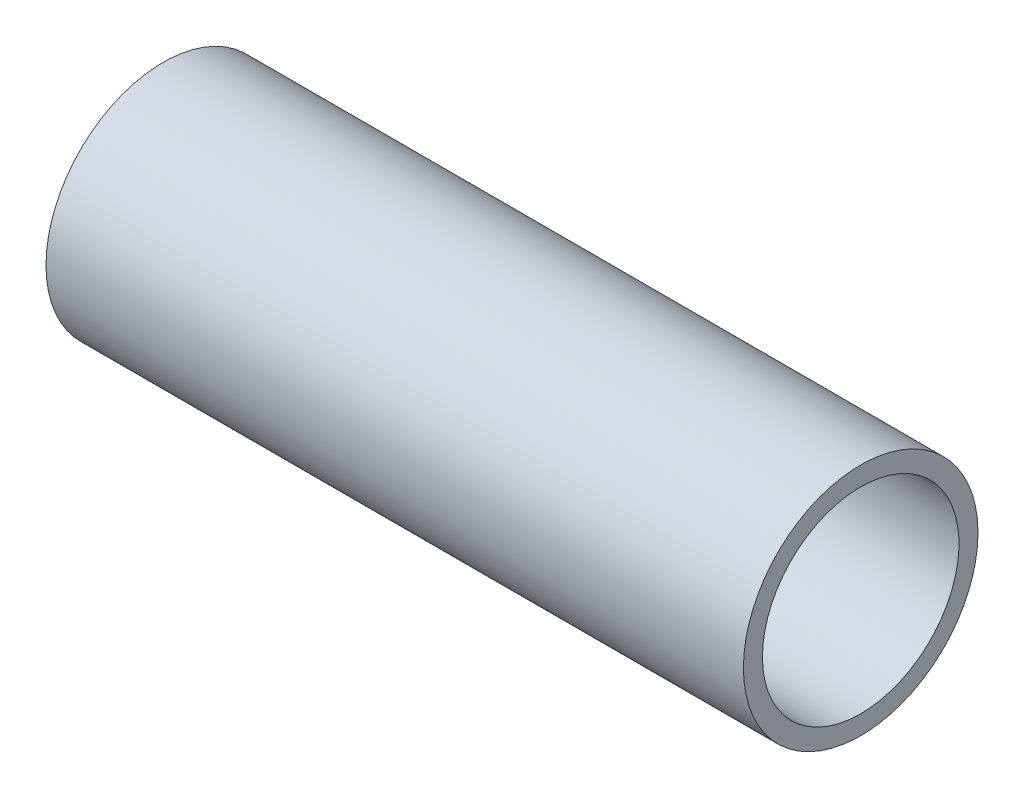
ISO-10303-21;
HEADER;
FILE_DESCRIPTION(('STEP AP214'),'2;1');
FILE_NAME('part.step','',(''),(''),'','','');
FILE_SCHEMA(('AUTOMOTIVE_DESIGN { 1 0 10303 214 1 1 1 1 }'));
ENDSEC;
DATA;
#1=APPLICATION_CONTEXT('core data for automotive mechanical design processes');
#2=APPLICATION_PROTOCOL_DEFINITION('international standard','automotive_design',2000,#1);
#3=PRODUCT_CONTEXT('',#1,'mechanical');
#4=PRODUCT('Part','Part','',(#3));
#5=PRODUCT_RELATED_PRODUCT_CATEGORY('part','',(#4));
#6=PRODUCT_DEFINITION_FORMATION('','',#4);
#7=PRODUCT_DEFINITION_CONTEXT('part definition',#1,'design');
#8=PRODUCT_DEFINITION('design','',#6,#7);
#9=PRODUCT_DEFINITION_SHAPE('','',#8);
#10=(LENGTH_UNIT() NAMED_UNIT(*) SI_UNIT(.MILLI.,.METRE.));
#11=(NAMED_UNIT(*) PLANE_ANGLE_UNIT() SI_UNIT($,.RADIAN.));
#12=(NAMED_UNIT(*) SI_UNIT($,.STERADIAN.) SOLID_ANGLE_UNIT());
#13=UNCERTAINTY_MEASURE_WITH_UNIT(LENGTH_MEASURE(1.E-05),#10,'distance_accuracy_value','');
#14=(GEOMETRIC_REPRESENTATION_CONTEXT(3) GLOBAL_UNCERTAINTY_ASSIGNED_CONTEXT((#13)) GLOBAL_UNIT_ASSIGNED_CONTEXT((#10,
#11,#12)) REPRESENTATION_CONTEXT('',''));
#15=CARTESIAN_POINT('',(0.,0.,0.));
#16=DIRECTION('',(0.,0.,1.));
#17=DIRECTION('',(1.,0.,0.));
#18=AXIS2_PLACEMENT_3D('',#15,#16,#17);
#19=CARTESIAN_POINT('',(0.,0.,0.));
#20=DIRECTION('',(-1.,0.,0.));
#21=DIRECTION('',(0.,0.,1.));
#22=AXIS2_PLACEMENT_3D('',#19,#20,#21);
#23=CYLINDRICAL_SURFACE('',#22,5.);
#24=CARTESIAN_POINT('',(3.,0.,0.));
#25=DIRECTION('',(-1.,0.,0.));
#26=DIRECTION('',(0.,0.,1.));
#27=AXIS2_PLACEMENT_3D('',#24,#25,#26);
#28=CIRCLE('',#27,5.);
#29=CARTESIAN_POINT('',(3.,0.,5.));
#30=VERTEX_POINT('',#29);
#31=EDGE_CURVE('E52',#30,#30,#28,.T.);
#32=ORIENTED_EDGE('',*,*,#31,.F.);
#33=EDGE_LOOP('',(#32));
#34=FACE_BOUND('',#33,.T.);
#35=CARTESIAN_POINT('',(0.,0.,0.));
#36=DIRECTION('',(-1.,0.,0.));
#37=DIRECTION('',(0.,0.,1.));
#38=AXIS2_PLACEMENT_3D('',#35,#36,#37);
#39=CIRCLE('',#38,5.);
#40=CARTESIAN_POINT('',(0.,0.,5.));
#41=VERTEX_POINT('',#40);
#42=EDGE_CURVE('E10',#41,#41,#39,.T.);
#43=ORIENTED_EDGE('',*,*,#42,.T.);
#44=EDGE_LOOP('',(#43));
#45=FACE_BOUND('',#44,.T.);
#46=ADVANCED_FACE('F30',(#34,#45),#23,.F.);
#47=CARTESIAN_POINT('',(0.,5.,0.));
#48=DIRECTION('',(1.,0.,0.));
#49=DIRECTION('',(0.,0.,-1.));
#50=AXIS2_PLACEMENT_3D('',#47,#48,#49);
#51=PLANE('',#50);
#52=ORIENTED_EDGE('',*,*,#42,.F.);
#53=EDGE_LOOP('',(#52));
#54=FACE_BOUND('',#53,.T.);
#55=CARTESIAN_POINT('',(0.,0.,0.));
#56=DIRECTION('',(-1.,0.,0.));
#57=DIRECTION('',(0.,0.,1.));
#58=AXIS2_PLACEMENT_3D('',#55,#56,#57);
#59=CIRCLE('',#58,18.5);
#60=CARTESIAN_POINT('',(0.,0.,18.5));
#61=VERTEX_POINT('',#60);
#62=EDGE_CURVE('E36',#61,#61,#59,.T.);
#63=ORIENTED_EDGE('',*,*,#62,.T.);
#64=EDGE_LOOP('',(#63));
#65=FACE_BOUND('',#64,.T.);
#66=ADVANCED_FACE('F59',(#54,#65),#51,.F.);
#67=CARTESIAN_POINT('',(0.,0.,0.));
#68=DIRECTION('',(-1.,0.,0.));
#69=DIRECTION('',(0.,0.,1.));
#70=AXIS2_PLACEMENT_3D('',#67,#68,#69);
#71=CYLINDRICAL_SURFACE('',#70,18.5);
#72=ORIENTED_EDGE('',*,*,#62,.F.);
#73=EDGE_LOOP('',(#72));
#74=FACE_BOUND('',#73,.T.);
#75=CARTESIAN_POINT('',(110.,0.,0.));
#76=DIRECTION('',(-1.,0.,0.));
#77=DIRECTION('',(0.,0.,1.));
#78=AXIS2_PLACEMENT_3D('',#75,#76,#77);
#79=CIRCLE('',#78,18.5);
#80=CARTESIAN_POINT('',(110.,0.,18.5));
#81=VERTEX_POINT('',#80);
#82=EDGE_CURVE('E40',#81,#81,#79,.T.);
#83=ORIENTED_EDGE('',*,*,#82,.T.);
#84=EDGE_LOOP('',(#83));
#85=FACE_BOUND('',#84,.T.);
#86=ADVANCED_FACE('F63',(#74,#85),#71,.T.);
#87=CARTESIAN_POINT('',(110.,18.5,0.));
#88=DIRECTION('',(-1.,0.,0.));
#89=DIRECTION('',(0.,0.,1.));
#90=AXIS2_PLACEMENT_3D('',#87,#88,#89);
#91=PLANE('',#90);
#92=ORIENTED_EDGE('',*,*,#82,.F.);
#93=EDGE_LOOP('',(#92));
#94=FACE_BOUND('',#93,.T.);
#95=CARTESIAN_POINT('',(110.,0.,0.));
#96=DIRECTION('',(-1.,0.,0.));
#97=DIRECTION('',(0.,0.,1.));
#98=AXIS2_PLACEMENT_3D('',#95,#96,#97);
#99=CIRCLE('',#98,15.5);
#100=CARTESIAN_POINT('',(110.,0.,15.5));
#101=VERTEX_POINT('',#100);
#102=EDGE_CURVE('E44',#101,#101,#99,.T.);
#103=ORIENTED_EDGE('',*,*,#102,.T.);
#104=EDGE_LOOP('',(#103));
#105=FACE_BOUND('',#104,.T.);
#106=ADVANCED_FACE('F68',(#94,#105),#91,.F.);
#107=CARTESIAN_POINT('',(0.,0.,0.));
#108=DIRECTION('',(-1.,0.,0.));
#109=DIRECTION('',(0.,0.,1.));
#110=AXIS2_PLACEMENT_3D('',#107,#108,#109);
#111=CYLINDRICAL_SURFACE('',#110,15.5);
#112=ORIENTED_EDGE('',*,*,#102,.F.);
#113=EDGE_LOOP('',(#112));
#114=FACE_BOUND('',#113,.T.);
#115=CARTESIAN_POINT('',(3.,0.,0.));
#116=DIRECTION('',(-1.,0.,0.));
#117=DIRECTION('',(0.,0.,1.));
#118=AXIS2_PLACEMENT_3D('',#115,#116,#117);
#119=CIRCLE('',#118,15.5);
#120=CARTESIAN_POINT('',(3.,0.,15.5));
#121=VERTEX_POINT('',#120);
#122=EDGE_CURVE('E49',#121,#121,#119,.T.);
#123=ORIENTED_EDGE('',*,*,#122,.T.);
#124=EDGE_LOOP('',(#123));
#125=FACE_BOUND('',#124,.T.);
#126=ADVANCED_FACE('F74',(#114,#125),#111,.F.);
#127=CARTESIAN_POINT('',(3.,15.5,0.));
#128=DIRECTION('',(-1.,0.,0.));
#129=DIRECTION('',(0.,0.,1.));
#130=AXIS2_PLACEMENT_3D('',#127,#128,#129);
#131=PLANE('',#130);
#132=ORIENTED_EDGE('',*,*,#122,.F.);
#133=EDGE_LOOP('',(#132));
#134=FACE_BOUND('',#133,.T.);
#135=ORIENTED_EDGE('',*,*,#31,.T.);
#136=EDGE_LOOP('',(#135));
#137=FACE_BOUND('',#136,.T.);
#138=ADVANCED_FACE('F56',(#134,#137),#131,.F.);
#139=CLOSED_SHELL('',(#46,#66,#86,#106,#126,#138));
#140=MANIFOLD_SOLID_BREP('B2',#139);
#141=ADVANCED_BREP_SHAPE_REPRESENTATION('',(#18,#140),#14);
#142=SHAPE_DEFINITION_REPRESENTATION(#9,#141);
ENDSEC;
END-ISO-10303-21;
